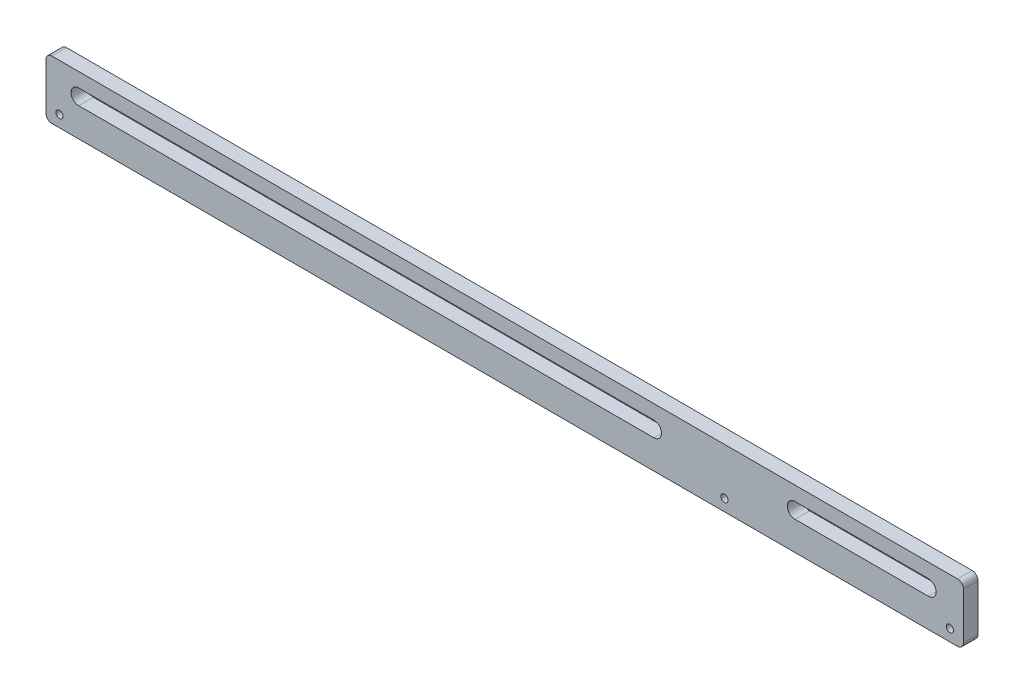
from build123d import *

# Parameters (mm, degrees)
SKETCH1_W           = 398.78
SKETCH1_H           = 25.4
BOSS_EXTRUDE1_DEPTH = 6.35
FILLET1_R           = 2.54
SKETCH2_R           = 1.575
CUT_EXTRUDE1_DEPTH  = 6.35


with BuildPart() as part:
    # Sketch1 → Boss-Extrude1 (new body)
    with BuildSketch(Plane.XY):
        with Locations((199.39, 12.7)):
            Rectangle(SKETCH1_W, SKETCH1_H)
        with BuildLine():
            Line((14.224, 19.215), (264.224, 19.215))
            ThreePointArc((264.224, 19.215), (267.564, 15.875), (264.224, 12.535))
            Line((264.224, 12.535), (14.224, 12.535))
            ThreePointArc((14.224, 12.535), (10.884, 15.875), (14.224, 19.215))
        make_face(mode=Mode.SUBTRACT)
        with BuildLine():
            Line((325.58, 19.215000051), (383.58, 19.215000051))
            ThreePointArc((383.58, 19.215000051), (386.920000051, 15.875), (383.58, 12.534999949))
            Line((383.58, 12.534999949), (325.58, 12.534999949))
            ThreePointArc((325.58, 12.534999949), (322.239999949, 15.875), (325.58, 19.215000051))
        make_face(mode=Mode.SUBTRACT)
    extrude(amount=BOSS_EXTRUDE1_DEPTH)

    # Fillet1
    fillet1_edges = [part.edges().sort_by_distance(p)[0] for p in [
        (0, 25.4, 3.175),
        (398.78, 25.4, 3.175),
        (398.78, 0, 3.175),
        (0, 0, 3.175),
    ]]
    fillet(fillet1_edges, radius=FILLET1_R)

    # Sketch2 → Cut-Extrude1 (cut)
    with BuildSketch(Plane.XY.offset(6.35)):
        with Locations((294.959789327, 5.08)):
            Circle(SKETCH2_R)
        with Locations((392.914121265, 5.08)):
            Circle(SKETCH2_R)
        with Locations((5.865878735, 5.08)):
            Circle(SKETCH2_R)
    extrude(amount=-CUT_EXTRUDE1_DEPTH, mode=Mode.SUBTRACT)


solid = part.part
